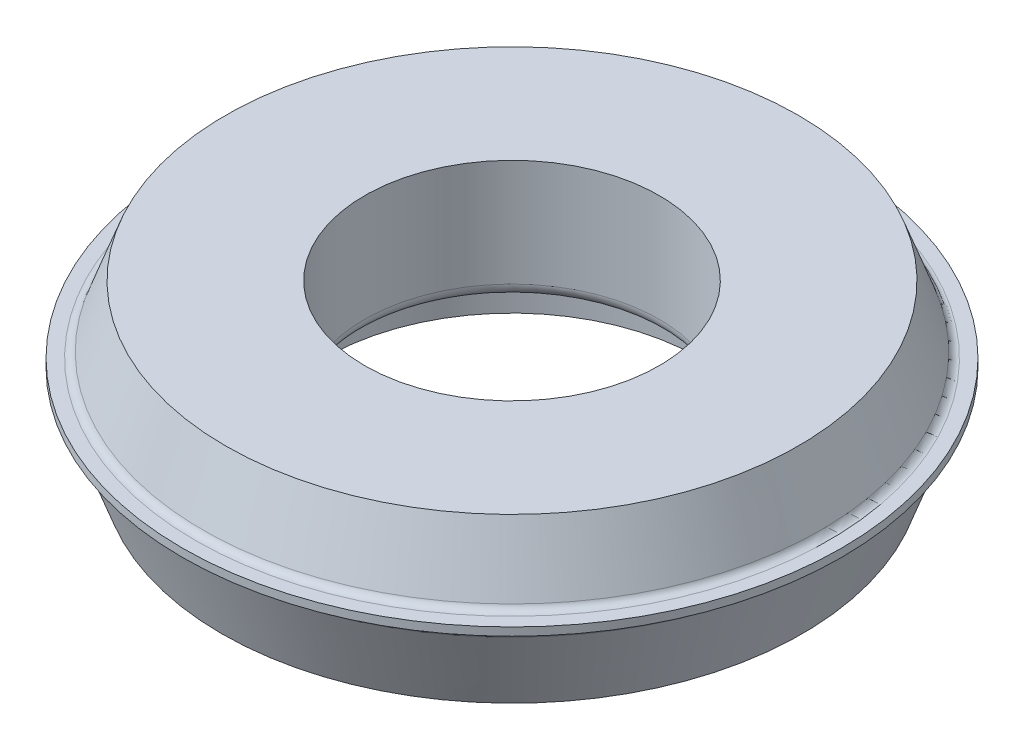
ISO-10303-21;
HEADER;
FILE_DESCRIPTION(('STEP AP214'),'2;1');
FILE_NAME('part.step','',(''),(''),'','','');
FILE_SCHEMA(('AUTOMOTIVE_DESIGN { 1 0 10303 214 1 1 1 1 }'));
ENDSEC;
DATA;
#1=APPLICATION_CONTEXT('core data for automotive mechanical design processes');
#2=APPLICATION_PROTOCOL_DEFINITION('international standard','automotive_design',2000,#1);
#3=PRODUCT_CONTEXT('',#1,'mechanical');
#4=PRODUCT('Part','Part','',(#3));
#5=PRODUCT_RELATED_PRODUCT_CATEGORY('part','',(#4));
#6=PRODUCT_DEFINITION_FORMATION('','',#4);
#7=PRODUCT_DEFINITION_CONTEXT('part definition',#1,'design');
#8=PRODUCT_DEFINITION('design','',#6,#7);
#9=PRODUCT_DEFINITION_SHAPE('','',#8);
#10=(LENGTH_UNIT() NAMED_UNIT(*) SI_UNIT(.MILLI.,.METRE.));
#11=(NAMED_UNIT(*) PLANE_ANGLE_UNIT() SI_UNIT($,.RADIAN.));
#12=(NAMED_UNIT(*) SI_UNIT($,.STERADIAN.) SOLID_ANGLE_UNIT());
#13=UNCERTAINTY_MEASURE_WITH_UNIT(LENGTH_MEASURE(1.E-05),#10,'distance_accuracy_value','');
#14=(GEOMETRIC_REPRESENTATION_CONTEXT(3) GLOBAL_UNCERTAINTY_ASSIGNED_CONTEXT((#13)) GLOBAL_UNIT_ASSIGNED_CONTEXT((#10,
#11,#12)) REPRESENTATION_CONTEXT('',''));
#15=CARTESIAN_POINT('',(0.,0.,0.));
#16=DIRECTION('',(0.,0.,1.));
#17=DIRECTION('',(1.,0.,0.));
#18=AXIS2_PLACEMENT_3D('',#15,#16,#17);
#19=CARTESIAN_POINT('',(70.,0.,0.));
#20=DIRECTION('',(0.,1.,0.));
#21=DIRECTION('',(0.,0.,1.));
#22=AXIS2_PLACEMENT_3D('',#19,#20,#21);
#23=PLANE('',#22);
#24=CARTESIAN_POINT('',(0.,0.,0.));
#25=DIRECTION('',(0.,1.,0.));
#26=DIRECTION('',(0.,0.,1.));
#27=AXIS2_PLACEMENT_3D('',#24,#25,#26);
#28=CIRCLE('',#27,108.352952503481);
#29=CARTESIAN_POINT('',(0.,0.,108.352952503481));
#30=VERTEX_POINT('',#29);
#31=EDGE_CURVE('E708',#30,#30,#28,.T.);
#32=ORIENTED_EDGE('',*,*,#31,.F.);
#33=EDGE_LOOP('',(#32));
#34=FACE_BOUND('',#33,.T.);
#35=CARTESIAN_POINT('',(0.,0.,0.));
#36=DIRECTION('',(0.,1.,0.));
#37=DIRECTION('',(0.,0.,1.));
#38=AXIS2_PLACEMENT_3D('',#35,#36,#37);
#39=CIRCLE('',#38,70.);
#40=CARTESIAN_POINT('',(0.,0.,70.));
#41=VERTEX_POINT('',#40);
#42=EDGE_CURVE('E682',#41,#41,#39,.T.);
#43=ORIENTED_EDGE('',*,*,#42,.T.);
#44=EDGE_LOOP('',(#43));
#45=FACE_BOUND('',#44,.T.);
#46=ADVANCED_FACE('F668',(#34,#45),#23,.F.);
#47=CARTESIAN_POINT('',(0.,-543.490427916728,0.));
#48=DIRECTION('',(0.,1.,0.));
#49=DIRECTION('',(0.,0.,1.));
#50=AXIS2_PLACEMENT_3D('',#47,#48,#49);
#51=CYLINDRICAL_SURFACE('',#50,70.);
#52=ORIENTED_EDGE('',*,*,#42,.F.);
#53=EDGE_LOOP('',(#52));
#54=FACE_BOUND('',#53,.T.);
#55=CARTESIAN_POINT('',(0.,15.,0.));
#56=DIRECTION('',(0.,1.,0.));
#57=DIRECTION('',(0.,0.,1.));
#58=AXIS2_PLACEMENT_3D('',#55,#56,#57);
#59=CIRCLE('',#58,70.);
#60=CARTESIAN_POINT('',(0.,15.,70.));
#61=VERTEX_POINT('',#60);
#62=EDGE_CURVE('E687',#61,#61,#59,.T.);
#63=ORIENTED_EDGE('',*,*,#62,.T.);
#64=EDGE_LOOP('',(#63));
#65=FACE_BOUND('',#64,.T.);
#66=ADVANCED_FACE('F716',(#54,#65),#51,.F.);
#67=CARTESIAN_POINT('',(70.,15.,0.));
#68=DIRECTION('',(0.,1.,0.));
#69=DIRECTION('',(0.,0.,1.));
#70=AXIS2_PLACEMENT_3D('',#67,#68,#69);
#71=PLANE('',#70);
#72=ORIENTED_EDGE('',*,*,#62,.F.);
#73=EDGE_LOOP('',(#72));
#74=FACE_BOUND('',#73,.T.);
#75=CARTESIAN_POINT('',(0.,15.,0.));
#76=DIRECTION('',(0.,1.,0.));
#77=DIRECTION('',(0.,0.,1.));
#78=AXIS2_PLACEMENT_3D('',#75,#76,#77);
#79=CIRCLE('',#78,60.0000000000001);
#80=CARTESIAN_POINT('',(0.,15.,60.0000000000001));
#81=VERTEX_POINT('',#80);
#82=EDGE_CURVE('E690',#81,#81,#79,.T.);
#83=ORIENTED_EDGE('',*,*,#82,.T.);
#84=EDGE_LOOP('',(#83));
#85=FACE_BOUND('',#84,.T.);
#86=ADVANCED_FACE('F721',(#74,#85),#71,.F.);
#87=CARTESIAN_POINT('',(0.,20.,0.));
#88=DIRECTION('',(0.,1.,0.));
#89=DIRECTION('',(0.,0.,1.));
#90=AXIS2_PLACEMENT_3D('',#87,#88,#89);
#91=TOROIDAL_SURFACE('',#90,60.,5.);
#92=ORIENTED_EDGE('',*,*,#82,.F.);
#93=EDGE_LOOP('',(#92));
#94=FACE_BOUND('',#93,.T.);
#95=CARTESIAN_POINT('',(0.,20.,0.));
#96=DIRECTION('',(0.,1.,0.));
#97=DIRECTION('',(0.,0.,1.));
#98=AXIS2_PLACEMENT_3D('',#95,#96,#97);
#99=CIRCLE('',#98,55.);
#100=CARTESIAN_POINT('',(0.,20.,55.));
#101=VERTEX_POINT('',#100);
#102=EDGE_CURVE('E693',#101,#101,#99,.T.);
#103=ORIENTED_EDGE('',*,*,#102,.T.);
#104=EDGE_LOOP('',(#103));
#105=FACE_BOUND('',#104,.T.);
#106=ADVANCED_FACE('F726',(#94,#105),#91,.T.);
#107=CARTESIAN_POINT('',(0.,-543.490427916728,0.));
#108=DIRECTION('',(0.,1.,0.));
#109=DIRECTION('',(0.,0.,1.));
#110=AXIS2_PLACEMENT_3D('',#107,#108,#109);
#111=CYLINDRICAL_SURFACE('',#110,55.);
#112=ORIENTED_EDGE('',*,*,#102,.F.);
#113=EDGE_LOOP('',(#112));
#114=FACE_BOUND('',#113,.T.);
#115=CARTESIAN_POINT('',(0.,60.0000000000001,0.));
#116=DIRECTION('',(0.,1.,0.));
#117=DIRECTION('',(0.,0.,1.));
#118=AXIS2_PLACEMENT_3D('',#115,#116,#117);
#119=CIRCLE('',#118,55.);
#120=CARTESIAN_POINT('',(0.,60.0000000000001,55.));
#121=VERTEX_POINT('',#120);
#122=EDGE_CURVE('E696',#121,#121,#119,.T.);
#123=ORIENTED_EDGE('',*,*,#122,.T.);
#124=EDGE_LOOP('',(#123));
#125=FACE_BOUND('',#124,.T.);
#126=ADVANCED_FACE('F732',(#114,#125),#111,.F.);
#127=CARTESIAN_POINT('',(106.900744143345,60.,0.));
#128=DIRECTION('',(0.,-1.,0.));
#129=DIRECTION('',(0.,0.,-1.));
#130=AXIS2_PLACEMENT_3D('',#127,#128,#129);
#131=PLANE('',#130);
#132=ORIENTED_EDGE('',*,*,#122,.F.);
#133=EDGE_LOOP('',(#132));
#134=FACE_BOUND('',#133,.T.);
#135=CARTESIAN_POINT('',(0.,60.0000000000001,0.));
#136=DIRECTION('',(0.,1.,0.));
#137=DIRECTION('',(0.,0.,1.));
#138=AXIS2_PLACEMENT_3D('',#135,#136,#137);
#139=CIRCLE('',#138,106.900744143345);
#140=CARTESIAN_POINT('',(0.,60.0000000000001,106.900744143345));
#141=VERTEX_POINT('',#140);
#142=EDGE_CURVE('E699',#141,#141,#139,.T.);
#143=ORIENTED_EDGE('',*,*,#142,.T.);
#144=EDGE_LOOP('',(#143));
#145=FACE_BOUND('',#144,.T.);
#146=ADVANCED_FACE('F738',(#134,#145),#131,.F.);
#147=CARTESIAN_POINT('',(0.,35.,0.));
#148=DIRECTION('',(0.,-1.,0.));
#149=DIRECTION('',(0.,0.,-1.));
#150=AXIS2_PLACEMENT_3D('',#147,#148,#149);
#151=CONICAL_SURFACE('',#150,116.,0.34906585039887);
#152=CARTESIAN_POINT('',(0.,36.973939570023,0.));
#153=DIRECTION('',(0.,-1.,0.));
#154=DIRECTION('',(0.,0.,-1.));
#155=AXIS2_PLACEMENT_3D('',#152,#153,#154);
#156=CIRCLE('',#155,115.281544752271);
#157=CARTESIAN_POINT('',(0.,36.973939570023,-115.281544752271));
#158=VERTEX_POINT('',#157);
#159=EDGE_CURVE('E678',#158,#158,#156,.F.);
#160=ORIENTED_EDGE('',*,*,#159,.T.);
#161=EDGE_LOOP('',(#160));
#162=FACE_BOUND('',#161,.T.);
#163=ORIENTED_EDGE('',*,*,#142,.F.);
#164=EDGE_LOOP('',(#163));
#165=FACE_BOUND('',#164,.T.);
#166=ADVANCED_FACE('F744',(#162,#165),#151,.T.);
#167=CARTESIAN_POINT('',(122.995,35.,0.));
#168=DIRECTION('',(0.,-1.,0.));
#169=DIRECTION('',(0.,0.,-1.));
#170=AXIS2_PLACEMENT_3D('',#167,#168,#169);
#171=PLANE('',#170);
#172=CARTESIAN_POINT('',(0.,35.,0.));
#173=DIRECTION('',(0.,-1.,0.));
#174=DIRECTION('',(0.,0.,-1.));
#175=AXIS2_PLACEMENT_3D('',#172,#173,#174);
#176=CIRCLE('',#175,118.100622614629);
#177=CARTESIAN_POINT('',(0.,35.,-118.100622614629));
#178=VERTEX_POINT('',#177);
#179=EDGE_CURVE('E674',#178,#178,#176,.T.);
#180=ORIENTED_EDGE('',*,*,#179,.T.);
#181=EDGE_LOOP('',(#180));
#182=FACE_BOUND('',#181,.T.);
#183=CARTESIAN_POINT('',(0.,35.,0.));
#184=DIRECTION('',(0.,1.,0.));
#185=DIRECTION('',(0.,0.,1.));
#186=AXIS2_PLACEMENT_3D('',#183,#184,#185);
#187=CIRCLE('',#186,122.995);
#188=CARTESIAN_POINT('',(0.,35.,122.995));
#189=VERTEX_POINT('',#188);
#190=EDGE_CURVE('E702',#189,#189,#187,.T.);
#191=ORIENTED_EDGE('',*,*,#190,.T.);
#192=EDGE_LOOP('',(#191));
#193=FACE_BOUND('',#192,.T.);
#194=ADVANCED_FACE('F749',(#182,#193),#171,.F.);
#195=CARTESIAN_POINT('',(0.,-543.490427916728,0.));
#196=DIRECTION('',(0.,1.,0.));
#197=DIRECTION('',(0.,0.,1.));
#198=AXIS2_PLACEMENT_3D('',#195,#196,#197);
#199=CYLINDRICAL_SURFACE('',#198,122.995);
#200=ORIENTED_EDGE('',*,*,#190,.F.);
#201=EDGE_LOOP('',(#200));
#202=FACE_BOUND('',#201,.T.);
#203=CARTESIAN_POINT('',(0.,32.,0.));
#204=DIRECTION('',(0.,1.,0.));
#205=DIRECTION('',(0.,0.,1.));
#206=AXIS2_PLACEMENT_3D('',#203,#204,#205);
#207=CIRCLE('',#206,122.995);
#208=CARTESIAN_POINT('',(0.,32.,122.995));
#209=VERTEX_POINT('',#208);
#210=EDGE_CURVE('E705',#209,#209,#207,.T.);
#211=ORIENTED_EDGE('',*,*,#210,.T.);
#212=EDGE_LOOP('',(#211));
#213=FACE_BOUND('',#212,.T.);
#214=ADVANCED_FACE('F756',(#202,#213),#199,.T.);
#215=CARTESIAN_POINT('',(0.,0.,0.));
#216=DIRECTION('',(0.,1.,0.));
#217=DIRECTION('',(0.,0.,1.));
#218=AXIS2_PLACEMENT_3D('',#215,#216,#217);
#219=CONICAL_SURFACE('',#218,108.352952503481,0.34906585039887);
#220=CARTESIAN_POINT('',(0.,28.7367711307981,0.));
#221=DIRECTION('',(0.,-1.,0.));
#222=DIRECTION('',(0.,0.,-1.));
#223=AXIS2_PLACEMENT_3D('',#220,#221,#222);
#224=CIRCLE('',#223,118.812281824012);
#225=CARTESIAN_POINT('',(0.,28.7367711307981,-118.812281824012));
#226=VERTEX_POINT('',#225);
#227=EDGE_CURVE('E10',#226,#226,#224,.T.);
#228=ORIENTED_EDGE('',*,*,#227,.T.);
#229=EDGE_LOOP('',(#228));
#230=FACE_BOUND('',#229,.T.);
#231=ORIENTED_EDGE('',*,*,#31,.T.);
#232=EDGE_LOOP('',(#231));
#233=FACE_BOUND('',#232,.T.);
#234=ADVANCED_FACE('F712',(#230,#233),#219,.T.);
#235=CARTESIAN_POINT('',(0.,38.,0.));
#236=DIRECTION('',(0.,-1.,0.));
#237=DIRECTION('',(0.,0.,-1.));
#238=AXIS2_PLACEMENT_3D('',#235,#236,#237);
#239=TOROIDAL_SURFACE('',#238,118.100622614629,3.);
#240=ORIENTED_EDGE('',*,*,#179,.F.);
#241=EDGE_LOOP('',(#240));
#242=FACE_BOUND('',#241,.T.);
#243=ORIENTED_EDGE('',*,*,#159,.F.);
#244=EDGE_LOOP('',(#243));
#245=FACE_BOUND('',#244,.T.);
#246=ADVANCED_FACE('F763',(#242,#245),#239,.F.);
#247=CARTESIAN_POINT('',(0.,27.0266704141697,0.));
#248=DIRECTION('',(0.,1.,0.));
#249=DIRECTION('',(0.,0.,1.));
#250=AXIS2_PLACEMENT_3D('',#247,#248,#249);
#251=TOROIDAL_SURFACE('',#250,123.510744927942,5.);
#252=ORIENTED_EDGE('',*,*,#227,.F.);
#253=EDGE_LOOP('',(#252));
#254=FACE_BOUND('',#253,.T.);
#255=ORIENTED_EDGE('',*,*,#210,.F.);
#256=EDGE_LOOP('',(#255));
#257=FACE_BOUND('',#256,.T.);
#258=ADVANCED_FACE('F766',(#254,#257),#251,.F.);
#259=CLOSED_SHELL('',(#46,#66,#86,#106,#126,#146,#166,#194,#214,#234,#246,#258));
#260=MANIFOLD_SOLID_BREP('B2',#259);
#261=ADVANCED_BREP_SHAPE_REPRESENTATION('',(#18,#260),#14);
#262=SHAPE_DEFINITION_REPRESENTATION(#9,#261);
ENDSEC;
END-ISO-10303-21;
